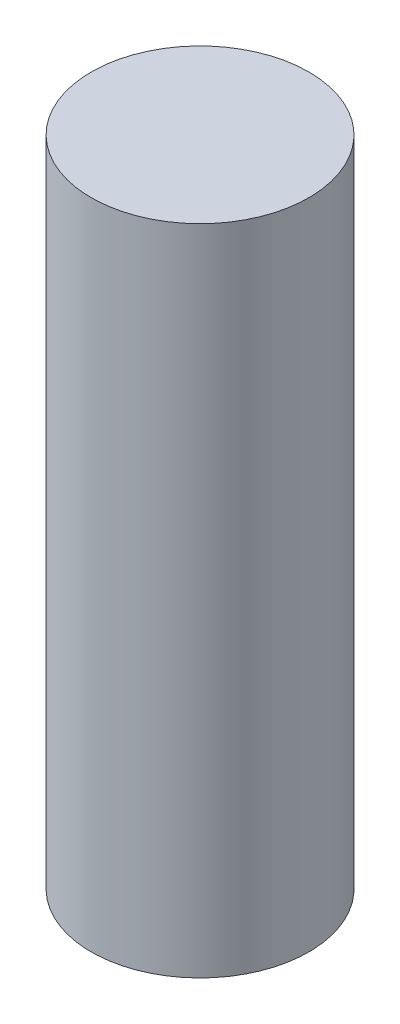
from build123d import *

# Parameters (mm, degrees)
ESQUISSE1_W = 5
ESQUISSE1_H = 30


with BuildPart() as part:
    # Esquisse1 → R_volution1 (revolve)
    with BuildSketch(Plane.XY, mode=Mode.PRIVATE) as r_volution1_sk:
        with Locations((-2.5, 15)):
            Rectangle(ESQUISSE1_W, ESQUISSE1_H)
    revolve(r_volution1_sk.sketch.rotate(Axis((0, -12.897101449, 0), (0, 1, 0)), 270), axis=Axis((0, -12.897101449, 0), (0, 1, 0)))


solid = part.part
